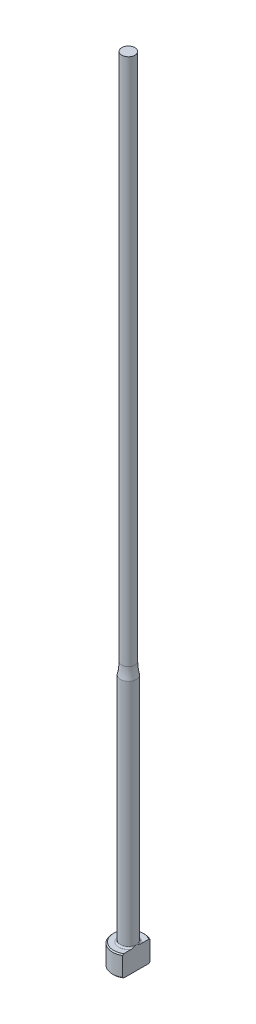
from build123d import *
from build123d.topology import SkipClean

# Parameters (mm, degrees)
CHAMFER1_SIZE    = 0.2
FILLET1_R        = 0.3
KEYED_HEAD_DEPTH = 151.059988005


with BuildPart() as part:
    # Sketch1 → Revolve1 (revolve)
    with BuildSketch(Plane.XY, mode=Mode.PRIVATE) as revolve1_sk:
        with BuildLine():
            Line((0, 0), (-3, 0))
            Line((-3, 0), (-3, 4))
            Line((-3, 4), (-1.5, 4))
            Line((-1.5, 4), (-1.5, 47.777951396))
            ThreePointArc((-1.5, 47.777951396), (-1.312696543, 48.881966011), (-1.25, 50))
            Line((-1.25, 50), (-1.25, 150))
            Line((-1.25, 150), (0, 150))
            Line((0, 150), (0, 0))
        make_face()
    revolve(revolve1_sk.sketch.rotate(Axis((0, 259.958771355, 0), (0, -1, 0)), 270), axis=Axis((0, 259.958771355, 0), (0, -1, 0)))

    # Chamfer1
    chamfer1_edges = [part.edges().sort_by_distance(p)[0] for p in [
        (0, 0, -3),
        (0, 4, -3),
    ]]
    chamfer(chamfer1_edges, length=CHAMFER1_SIZE)

    # Fillet1
    fillet1_edges = [part.edges().sort_by_distance(p)[0] for p in [
        (0, 4, -1.5),
    ]]
    fillet(fillet1_edges, radius=FILLET1_R)

    # Sketch2 → Keyed Head (cut, through all)
    with SkipClean():  # the faces are left unmerged after this step: merging them gives an invalid solid
        with BuildSketch(Plane(origin=(0, 0, 0), x_dir=(1, 0, 0), z_dir=(0, 1, 0))):
            with BuildLine():
                Line((1.5, -2.598076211), (1.5, 2.598076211))
                ThreePointArc((1.5, 2.598076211), (3, 0), (1.5, -2.598076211))
            make_face()
        extrude(amount=KEYED_HEAD_DEPTH, mode=Mode.SUBTRACT)


solid = part.part
